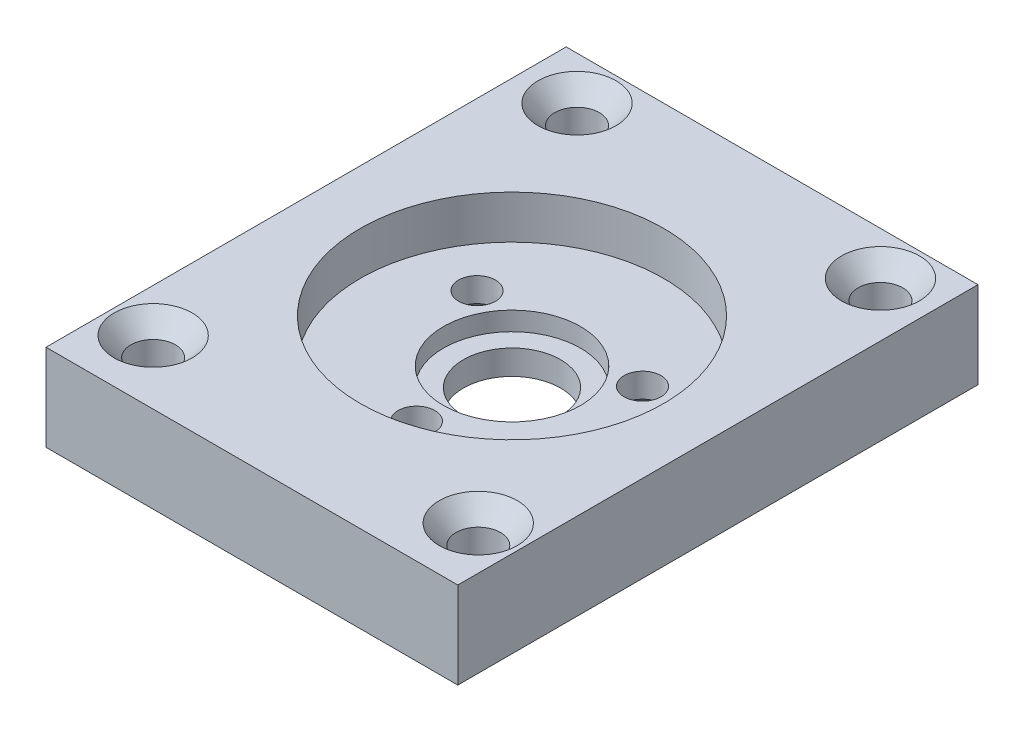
from build123d import *

# Parameters (mm, degrees)
SKETCH1_W                                         = 38.1
SKETCH1_H                                         = 6.35
EXTRUDE1_DEPTH                                    = 15.08125
SKETCH2_R                                         = 11.1125
CUT_EXTRUDE1_DEPTH                                = 3.175
SKETCH3_R                                         = 5.0165
CUT_EXTRUDE2_DEPTH                                = 1.3716
CUT_EXTRUDE3_REACH                                = 26.719
SKETCH4_R                                         = 3.556
CUT_EXTRUDE4_REACH                                = 27.113
SKETCH5_R                                         = 1.016
CSK_FOR_M2_5_FLAT_HEAD_MACHINE_SCREW1_D           = 2.7
CSK_FOR_M2_5_FLAT_HEAD_MACHINE_SCREW1_CSINK_D     = 5.5
CSK_FOR_M2_5_FLAT_HEAD_MACHINE_SCREW1_CSINK_ANGLE = 90
CSK_FOR_4_FLAT_HEAD_MACHINE_SCREW2_D              = 3.2639
CSK_FOR_4_FLAT_HEAD_MACHINE_SCREW2_CSINK_D        = 5.715
CSK_FOR_4_FLAT_HEAD_MACHINE_SCREW2_CSINK_ANGLE    = 82
CSK_FOR_4_FLAT_HEAD_MACHINE_SCREW1_D              = 3.2639
CSK_FOR_4_FLAT_HEAD_MACHINE_SCREW1_CSINK_D        = 5.715
CSK_FOR_4_FLAT_HEAD_MACHINE_SCREW1_CSINK_ANGLE    = 82


with BuildPart() as part:
    # Sketch1 → Extrude1 (new, symmetric)
    with BuildSketch(Plane(origin=(0, 0, 0), x_dir=(0, 0, -1), z_dir=(1, 0, 0))):
        Rectangle(SKETCH1_W, SKETCH1_H)
    extrude(amount=EXTRUDE1_DEPTH, both=True)

    # Sketch2 → Cut-Extrude1 (cut)
    with BuildSketch(Plane(origin=(0, 3.175, 0), x_dir=(1, 0, 0), z_dir=(0, 1, 0))):
        with Locations(Location((0, 0, 0), (0, 0, 270))):
            Circle(SKETCH2_R)
    extrude(amount=-CUT_EXTRUDE1_DEPTH, mode=Mode.SUBTRACT)

    # Sketch3 → Cut-Extrude2 (cut)
    with BuildSketch(Plane(origin=(0, 0, 0), x_dir=(1, 0, 0), z_dir=(0, 1, 0))):
        with Locations(Location((0, 0, 0), (0, 0, 270))):
            Circle(SKETCH3_R)
    extrude(amount=-CUT_EXTRUDE2_DEPTH, mode=Mode.SUBTRACT)

    # Sketch4 → Cut-Extrude3 (cut, up to next)
    with BuildSketch(Plane(origin=(0, -1.3716, 0), x_dir=(1, 0, 0), z_dir=(0, 1, 0)), mode=Mode.PRIVATE) as cut_extrude3_sk1:
        with Locations(Location((0, 0, 0), (0, 0, 270))):
            Circle(SKETCH4_R)
    cut_extrude3_tool1 = extrude(cut_extrude3_sk1.sketch, amount=-CUT_EXTRUDE3_REACH, mode=Mode.PRIVATE) & part.part
    add(cut_extrude3_tool1.solids().sort_by_distance((0, -1.3716, 0))[0], mode=Mode.SUBTRACT)

    # Sketch5 → Cut-Extrude4 (cut, up to next)
    with BuildSketch(Plane.XZ.offset(3.175), mode=Mode.PRIVATE) as cut_extrude4_sk1:
        with Locations(Location((0, 6.9977, 0), (0, 0, 270))):
            Circle(SKETCH5_R)
    cut_extrude4_tool1 = extrude(cut_extrude4_sk1.sketch, amount=-CUT_EXTRUDE4_REACH, mode=Mode.PRIVATE) & part.part
    # Sketch5 → Cut-Extrude4 (cut, up to next)
    with BuildSketch(Plane.XZ.offset(3.175), mode=Mode.PRIVATE) as cut_extrude4_sk2:
        with Locations(Location((6.060185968, -3.49885, 0), (0, 0, 270))):
            Circle(SKETCH5_R)
    cut_extrude4_tool2 = extrude(cut_extrude4_sk2.sketch, amount=-CUT_EXTRUDE4_REACH, mode=Mode.PRIVATE) & part.part
    # Sketch5 → Cut-Extrude4 (cut, up to next)
    with BuildSketch(Plane.XZ.offset(3.175), mode=Mode.PRIVATE) as cut_extrude4_sk3:
        with Locations(Location((-6.060185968, -3.49885, 0), (0, 0, 270))):
            Circle(SKETCH5_R)
    cut_extrude4_tool3 = extrude(cut_extrude4_sk3.sketch, amount=-CUT_EXTRUDE4_REACH, mode=Mode.PRIVATE) & part.part
    add(cut_extrude4_tool1.solids().sort_by_distance((0, -3.175, 6.9977))[0], mode=Mode.SUBTRACT)
    add(cut_extrude4_tool2.solids().sort_by_distance((6.060186, -3.175, -3.49885))[0], mode=Mode.SUBTRACT)
    add(cut_extrude4_tool3.solids().sort_by_distance((-6.060186, -3.175, -3.49885))[0], mode=Mode.SUBTRACT)

    # CSK for M2.5 Flat Head Machine Screw1 (through all)
    with Locations(Plane(origin=(6.060185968, -3.175, -3.49885), x_dir=(0, 0, -1), z_dir=(0, -1, 0))):
        with Locations((0, 0), (0, -12.120371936), (-10.49655, -6.060185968)):
            CounterSinkHole(CSK_FOR_M2_5_FLAT_HEAD_MACHINE_SCREW1_D / 2, CSK_FOR_M2_5_FLAT_HEAD_MACHINE_SCREW1_CSINK_D / 2, counter_sink_angle=CSK_FOR_M2_5_FLAT_HEAD_MACHINE_SCREW1_CSINK_ANGLE)

    # CSK for _4 Flat Head Machine Screw2 (through all)
    with Locations(Plane(origin=(0, 3.175, 0), x_dir=(1, 0, 0), z_dir=(0, 1, 0))):
        with Locations((11.90625, -14.3764), (-11.90625, -14.3764)):
            CounterSinkHole(CSK_FOR_4_FLAT_HEAD_MACHINE_SCREW2_D / 2, CSK_FOR_4_FLAT_HEAD_MACHINE_SCREW2_CSINK_D / 2, counter_sink_angle=CSK_FOR_4_FLAT_HEAD_MACHINE_SCREW2_CSINK_ANGLE)

    # CSK for _4 Flat Head Machine Screw1 (through all)
    with Locations(Plane(origin=(0, 3.175, 0), x_dir=(-1, 0, 0), z_dir=(0, 1, 0))):
        with Locations((-11.1125, -15.875), (11.1125, -15.875)):
            CounterSinkHole(CSK_FOR_4_FLAT_HEAD_MACHINE_SCREW1_D / 2, CSK_FOR_4_FLAT_HEAD_MACHINE_SCREW1_CSINK_D / 2, counter_sink_angle=CSK_FOR_4_FLAT_HEAD_MACHINE_SCREW1_CSINK_ANGLE)


solid = part.part
